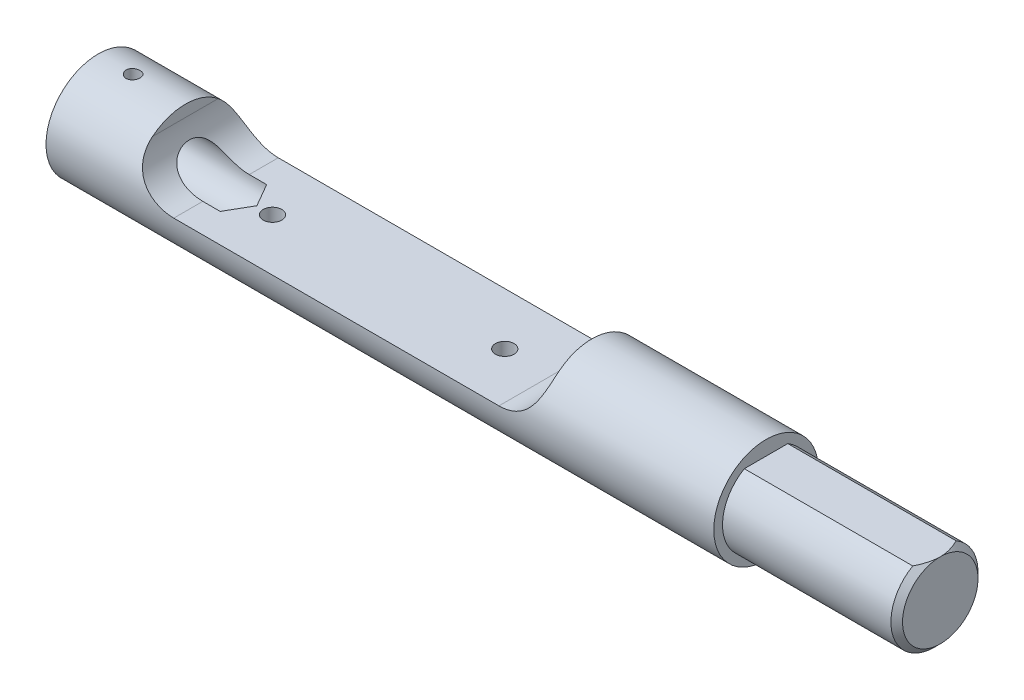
from build123d import *

# Parameters (mm, degrees)
CHANFREIN1_SIZE              = 1
ENL_V_MAT_EXTRU_1_DEPTH      = 146.557548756
ENL_V_MAT_EXTRU_1_DEPTH_BACK = 146.557548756
ESQUISSE3_W                  = 30
ESQUISSE3_H                  = 1
PER_AGE1_D                   = 8
PER_AGE1_DEPTH               = 25
PER_AGE1_TIP                 = 2.309401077
ESQUISSE6_R                  = 1.6
ENL_V_MAT_EXTRU_2_DEPTH      = 146.557548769
R_P_TITION_LIN_AIRE1_COUNT   = 2
R_P_TITION_LIN_AIRE1_PITCH   = 40
ESQUISSE7_R                  = 1.2
ENL_V_MAT_EXTRU_3_DEPTH      = 146.557548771


with BuildPart() as part:
    # Esquisse1 → Base-R_volution (revolve)
    with BuildSketch(Plane.XY, mode=Mode.PRIVATE) as base_r_volution_sk:
        Polygon((0, 0), (0, 9), (115, 9), (115, 7.5), (145, 7.5), (145, 0), align=None)
    revolve(base_r_volution_sk.sketch.rotate(Axis((0, 0, 0), (1, 0, 0)), 90), axis=Axis((0, 0, 0), (1, 0, 0)))

    # Chanfrein1
    chanfrein1_edges = [part.edges().sort_by_distance(p)[0] for p in [
        (145, 0, -7.5),
    ]]
    chamfer(chanfrein1_edges, length=CHANFREIN1_SIZE)

    # Esquisse3 → Enl_v. mat.-Extru.1 (cut, two sides: drawn at the far end of the back side and taken through both)
    with BuildSketch(Plane.XY.offset(-ENL_V_MAT_EXTRU_1_DEPTH_BACK)):
        with Locations((130, 7)):
            Rectangle(ESQUISSE3_W, ESQUISSE3_H)
        with BuildLine():
            Line((85, 9), (15, 9))
            Line((15, 9), (15, 7))
            ThreePointArc((15, 7), (17.050252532, 2.050252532), (22, 0))
            Line((22, 0), (78, 0))
            ThreePointArc((78, 0), (82.949747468, 2.050252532), (85, 7))
            Line((85, 7), (85, 9))
        make_face()
    extrude(amount=ENL_V_MAT_EXTRU_1_DEPTH + ENL_V_MAT_EXTRU_1_DEPTH_BACK, mode=Mode.SUBTRACT)

    # Per_age1
    with Locations(Plane.ZY):
        with Locations((0, 0)):
            Hole(PER_AGE1_D / 2, depth=PER_AGE1_DEPTH)
            with Locations((0, 0, -(PER_AGE1_DEPTH + PER_AGE1_TIP / 2))):  # 120° drill point
                Cone(0, PER_AGE1_D / 2, PER_AGE1_TIP, mode=Mode.SUBTRACT)

    # Esquisse6 → Enl_v. mat.-Extru.2 (cut, through all)
    with BuildSketch(Plane(origin=(0, 0, 0), x_dir=(-1, 0, 0), z_dir=(0, 1, 0))):
        with Locations(Location((-30, 0, 0), (0, 0, 90))):
            Circle(ESQUISSE6_R)
    enl_v_mat_extru_2 = extrude(amount=-ENL_V_MAT_EXTRU_2_DEPTH, mode=Mode.SUBTRACT)

    # R_p_tition lin_aire1: Enl_v. mat.-Extru.2 ×2
    with Locations(*[(i * R_P_TITION_LIN_AIRE1_PITCH, 0, 0) for i in range(1, R_P_TITION_LIN_AIRE1_COUNT)]):
        add(enl_v_mat_extru_2, mode=Mode.SUBTRACT)

    # Esquisse7 → Enl_v. mat.-Extru.3 (cut, through all)
    with BuildSketch(Plane(origin=(0, 0, 0), x_dir=(-1, 0, 0), z_dir=(0, 1, 0))):
        with Locations(Location((-6, 0, 0), (0, 0, 270))):
            Circle(ESQUISSE7_R)
    extrude(amount=ENL_V_MAT_EXTRU_3_DEPTH, mode=Mode.SUBTRACT)


solid = part.part
